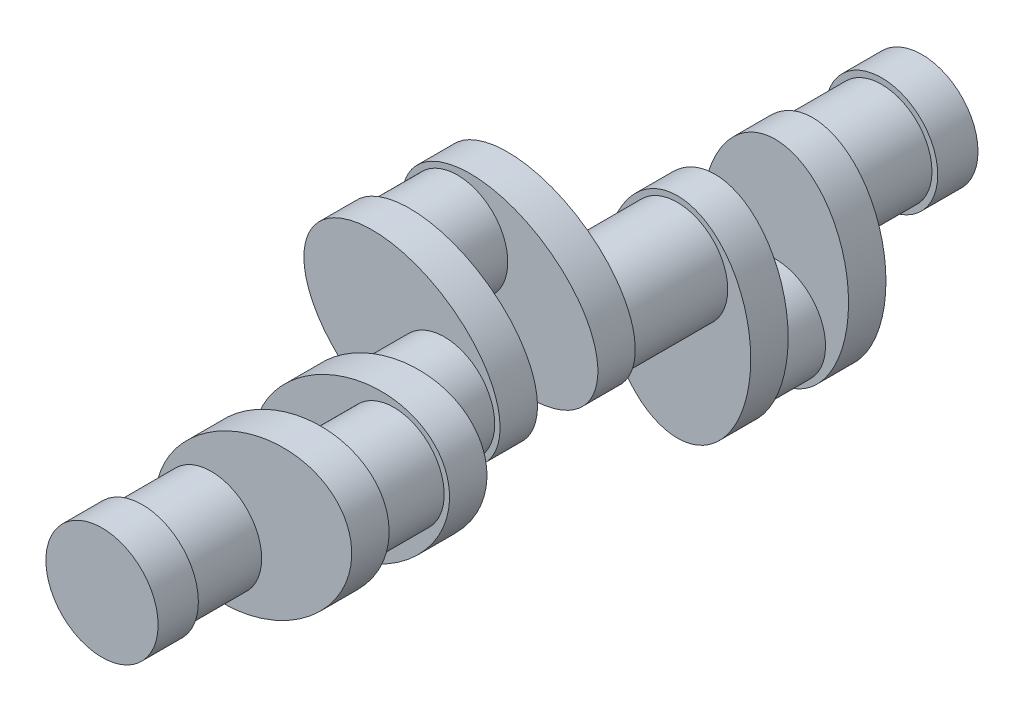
ISO-10303-21;
HEADER;
FILE_DESCRIPTION(('STEP AP214'),'2;1');
FILE_NAME('part.step','',(''),(''),'','','');
FILE_SCHEMA(('AUTOMOTIVE_DESIGN { 1 0 10303 214 1 1 1 1 }'));
ENDSEC;
DATA;
#1=APPLICATION_CONTEXT('core data for automotive mechanical design processes');
#2=APPLICATION_PROTOCOL_DEFINITION('international standard','automotive_design',2000,#1);
#3=PRODUCT_CONTEXT('',#1,'mechanical');
#4=PRODUCT('Part','Part','',(#3));
#5=PRODUCT_RELATED_PRODUCT_CATEGORY('part','',(#4));
#6=PRODUCT_DEFINITION_FORMATION('','',#4);
#7=PRODUCT_DEFINITION_CONTEXT('part definition',#1,'design');
#8=PRODUCT_DEFINITION('design','',#6,#7);
#9=PRODUCT_DEFINITION_SHAPE('','',#8);
#10=(LENGTH_UNIT() NAMED_UNIT(*) SI_UNIT(.MILLI.,.METRE.));
#11=(NAMED_UNIT(*) PLANE_ANGLE_UNIT() SI_UNIT($,.RADIAN.));
#12=(NAMED_UNIT(*) SI_UNIT($,.STERADIAN.) SOLID_ANGLE_UNIT());
#13=UNCERTAINTY_MEASURE_WITH_UNIT(LENGTH_MEASURE(1.E-05),#10,'distance_accuracy_value','');
#14=(GEOMETRIC_REPRESENTATION_CONTEXT(3) GLOBAL_UNCERTAINTY_ASSIGNED_CONTEXT((#13)) GLOBAL_UNIT_ASSIGNED_CONTEXT((#10,
#11,#12)) REPRESENTATION_CONTEXT('',''));
#15=CARTESIAN_POINT('',(0.,0.,0.));
#16=DIRECTION('',(0.,0.,1.));
#17=DIRECTION('',(1.,0.,0.));
#18=AXIS2_PLACEMENT_3D('',#15,#16,#17);
#19=CARTESIAN_POINT('',(0.,-17.,51.));
#20=DIRECTION('',(0.,0.,1.));
#21=DIRECTION('',(0.,1.,0.));
#22=AXIS2_PLACEMENT_3D('',#19,#20,#21);
#23=ELLIPSE('',#22,36.5,25.5);
#24=DIRECTION('',(0.,0.,-1.));
#25=VECTOR('',#24,1.);
#26=SURFACE_OF_LINEAR_EXTRUSION('',#23,#25);
#27=CARTESIAN_POINT('',(0.,19.5,51.));
#28=VERTEX_POINT('',#27);
#29=EDGE_CURVE('E44',#28,#28,#23,.T.);
#30=ORIENTED_EDGE('',*,*,#29,.F.);
#31=EDGE_LOOP('',(#30));
#32=FACE_BOUND('',#31,.T.);
#33=CARTESIAN_POINT('',(0.,-17.,38.));
#34=DIRECTION('',(0.,0.,1.));
#35=DIRECTION('',(0.,1.,0.));
#36=AXIS2_PLACEMENT_3D('',#33,#34,#35);
#37=ELLIPSE('',#36,36.5,25.5);
#38=CARTESIAN_POINT('',(0.,19.5,38.));
#39=VERTEX_POINT('',#38);
#40=EDGE_CURVE('E36',#39,#39,#37,.T.);
#41=ORIENTED_EDGE('',*,*,#40,.T.);
#42=EDGE_LOOP('',(#41));
#43=FACE_BOUND('',#42,.T.);
#44=ADVANCED_FACE('F32',(#32,#43),#26,.F.);
#45=CARTESIAN_POINT('',(0.,-17.,51.));
#46=DIRECTION('',(0.,0.,1.));
#47=DIRECTION('',(1.,0.,0.));
#48=AXIS2_PLACEMENT_3D('',#45,#46,#47);
#49=PLANE('',#48);
#50=CARTESIAN_POINT('',(0.,-34.,51.));
#51=DIRECTION('',(0.,0.,1.));
#52=DIRECTION('',(1.,0.,0.));
#53=AXIS2_PLACEMENT_3D('',#50,#51,#52);
#54=CIRCLE('',#53,17.5);
#55=CARTESIAN_POINT('',(-17.5,-34.,51.));
#56=VERTEX_POINT('',#55);
#57=EDGE_CURVE('E39',#56,#56,#54,.T.);
#58=ORIENTED_EDGE('',*,*,#57,.F.);
#59=EDGE_LOOP('',(#58));
#60=FACE_BOUND('',#59,.T.);
#61=ORIENTED_EDGE('',*,*,#29,.T.);
#62=EDGE_LOOP('',(#61));
#63=FACE_BOUND('',#62,.T.);
#64=ADVANCED_FACE('F71',(#60,#63),#49,.T.);
#65=CARTESIAN_POINT('',(0.,-17.,38.));
#66=DIRECTION('',(0.,0.,1.));
#67=DIRECTION('',(1.,0.,0.));
#68=AXIS2_PLACEMENT_3D('',#65,#66,#67);
#69=PLANE('',#68);
#70=CARTESIAN_POINT('',(0.,0.,38.));
#71=DIRECTION('',(0.,0.,1.));
#72=DIRECTION('',(1.,0.,0.));
#73=AXIS2_PLACEMENT_3D('',#70,#71,#72);
#74=CIRCLE('',#73,17.5);
#75=CARTESIAN_POINT('',(17.5,0.,38.));
#76=VERTEX_POINT('',#75);
#77=EDGE_CURVE('E479',#76,#76,#74,.T.);
#78=ORIENTED_EDGE('',*,*,#77,.T.);
#79=EDGE_LOOP('',(#78));
#80=FACE_BOUND('',#79,.T.);
#81=ORIENTED_EDGE('',*,*,#40,.F.);
#82=EDGE_LOOP('',(#81));
#83=FACE_BOUND('',#82,.T.);
#84=ADVANCED_FACE('F69',(#80,#83),#69,.F.);
#85=CARTESIAN_POINT('',(0.,-34.,72.));
#86=DIRECTION('',(0.,0.,-1.));
#87=DIRECTION('',(-1.,0.,0.));
#88=AXIS2_PLACEMENT_3D('',#85,#86,#87);
#89=CYLINDRICAL_SURFACE('',#88,17.5);
#90=CARTESIAN_POINT('',(0.,-34.,72.));
#91=DIRECTION('',(0.,0.,1.));
#92=DIRECTION('',(1.,0.,0.));
#93=AXIS2_PLACEMENT_3D('',#90,#91,#92);
#94=CIRCLE('',#93,17.5);
#95=CARTESIAN_POINT('',(-17.5,-34.,72.));
#96=VERTEX_POINT('',#95);
#97=EDGE_CURVE('E54',#96,#96,#94,.T.);
#98=CARTESIAN_POINT('',(-17.5,-34.,72.));
#99=CARTESIAN_POINT('',(-17.5,-34.,71.78125));
#100=CARTESIAN_POINT('',(-17.5,-34.,71.5625));
#101=CARTESIAN_POINT('',(-17.5,-34.,71.125));
#102=CARTESIAN_POINT('',(-17.5,-34.,70.90625));
#103=CARTESIAN_POINT('',(-17.5,-34.,70.46875));
#104=CARTESIAN_POINT('',(-17.5,-34.,70.25));
#105=CARTESIAN_POINT('',(-17.5,-34.,69.8125));
#106=CARTESIAN_POINT('',(-17.5,-34.,69.59375));
#107=CARTESIAN_POINT('',(-17.5,-34.,69.15625));
#108=CARTESIAN_POINT('',(-17.5,-34.,68.9375));
#109=CARTESIAN_POINT('',(-17.5,-34.,68.5));
#110=CARTESIAN_POINT('',(-17.5,-34.,68.28125));
#111=CARTESIAN_POINT('',(-17.5,-34.,67.84375));
#112=CARTESIAN_POINT('',(-17.5,-34.,67.625));
#113=CARTESIAN_POINT('',(-17.5,-34.,67.1875));
#114=CARTESIAN_POINT('',(-17.5,-34.,66.96875));
#115=CARTESIAN_POINT('',(-17.5,-34.,66.53125));
#116=CARTESIAN_POINT('',(-17.5,-34.,66.3125));
#117=CARTESIAN_POINT('',(-17.5,-34.,65.875));
#118=CARTESIAN_POINT('',(-17.5,-34.,65.65625));
#119=CARTESIAN_POINT('',(-17.5,-34.,65.21875));
#120=CARTESIAN_POINT('',(-17.5,-34.,65.));
#121=CARTESIAN_POINT('',(-17.5,-34.,64.5625));
#122=CARTESIAN_POINT('',(-17.5,-34.,64.34375));
#123=CARTESIAN_POINT('',(-17.5,-34.,63.90625));
#124=CARTESIAN_POINT('',(-17.5,-34.,63.6875));
#125=CARTESIAN_POINT('',(-17.5,-34.,63.25));
#126=CARTESIAN_POINT('',(-17.5,-34.,63.03125));
#127=CARTESIAN_POINT('',(-17.5,-34.,62.59375));
#128=CARTESIAN_POINT('',(-17.5,-34.,62.375));
#129=CARTESIAN_POINT('',(-17.5,-34.,61.9375));
#130=CARTESIAN_POINT('',(-17.5,-34.,61.71875));
#131=CARTESIAN_POINT('',(-17.5,-34.,61.28125));
#132=CARTESIAN_POINT('',(-17.5,-34.,61.0625));
#133=CARTESIAN_POINT('',(-17.5,-34.,60.625));
#134=CARTESIAN_POINT('',(-17.5,-34.,60.40625));
#135=CARTESIAN_POINT('',(-17.5,-34.,59.96875));
#136=CARTESIAN_POINT('',(-17.5,-34.,59.75));
#137=CARTESIAN_POINT('',(-17.5,-34.,59.3125));
#138=CARTESIAN_POINT('',(-17.5,-34.,59.09375));
#139=CARTESIAN_POINT('',(-17.5,-34.,58.65625));
#140=CARTESIAN_POINT('',(-17.5,-34.,58.4375));
#141=CARTESIAN_POINT('',(-17.5,-34.,58.));
#142=CARTESIAN_POINT('',(-17.5,-34.,57.78125));
#143=CARTESIAN_POINT('',(-17.5,-34.,57.34375));
#144=CARTESIAN_POINT('',(-17.5,-34.,57.125));
#145=CARTESIAN_POINT('',(-17.5,-34.,56.6875));
#146=CARTESIAN_POINT('',(-17.5,-34.,56.46875));
#147=CARTESIAN_POINT('',(-17.5,-34.,56.03125));
#148=CARTESIAN_POINT('',(-17.5,-34.,55.8125));
#149=CARTESIAN_POINT('',(-17.5,-34.,55.375));
#150=CARTESIAN_POINT('',(-17.5,-34.,55.15625));
#151=CARTESIAN_POINT('',(-17.5,-34.,54.71875));
#152=CARTESIAN_POINT('',(-17.5,-34.,54.5));
#153=CARTESIAN_POINT('',(-17.5,-34.,54.0625));
#154=CARTESIAN_POINT('',(-17.5,-34.,53.84375));
#155=CARTESIAN_POINT('',(-17.5,-34.,53.40625));
#156=CARTESIAN_POINT('',(-17.5,-34.,53.1875));
#157=CARTESIAN_POINT('',(-17.5,-34.,52.75));
#158=CARTESIAN_POINT('',(-17.5,-34.,52.53125));
#159=CARTESIAN_POINT('',(-17.5,-34.,52.09375));
#160=CARTESIAN_POINT('',(-17.5,-34.,51.875));
#161=CARTESIAN_POINT('',(-17.5,-34.,51.4375));
#162=CARTESIAN_POINT('',(-17.5,-34.,51.21875));
#163=CARTESIAN_POINT('',(-17.5,-34.,51.));
#164=B_SPLINE_CURVE_WITH_KNOTS('',3,(#98,#99,#100,#101,#102,#103,#104,#105,#106,#107,#108,#109,
#110,#111,#112,#113,#114,#115,#116,#117,#118,#119,#120,#121,#122,#123,#124,#125,#126,#127,#128,
#129,#130,#131,#132,#133,#134,#135,#136,#137,#138,#139,#140,#141,#142,#143,#144,#145,#146,#147,
#148,#149,#150,#151,#152,#153,#154,#155,#156,#157,#158,#159,#160,#161,#162,#163),.UNSPECIFIED.,
.F.,.F.,(4,2,2,2,2,2,2,2,2,2,2,2,2,2,2,2,2,2,2,2,2,2,2,2,2,2,2,2,2,2,2,2,4),(0.,
0.656249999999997,1.31249999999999,1.96874999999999,2.62499999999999,3.28124999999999,3.9375,
4.59374999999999,5.24999999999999,5.90624999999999,6.56249999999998,7.21875,7.87499999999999,
8.53124999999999,9.18749999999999,9.84374999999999,10.5,11.15625,11.8125,12.46875,13.125,
13.78125,14.4375,15.09375,15.75,16.40625,17.0625,17.71875,18.375,19.03125,19.6875,20.34375,21.),.UNSPECIFIED.);
#165=EDGE_CURVE('BSEAM63',#96,#56,#164,.T.);
#166=ORIENTED_EDGE('',*,*,#97,.F.);
#167=ORIENTED_EDGE('',*,*,#57,.T.);
#168=ORIENTED_EDGE('',*,*,#165,.T.);
#169=ORIENTED_EDGE('',*,*,#165,.F.);
#170=EDGE_LOOP('',(#166,#168,#167,#169));
#171=FACE_BOUND('',#170,.T.);
#172=ADVANCED_FACE('F63',(#171),#89,.T.);
#173=CARTESIAN_POINT('',(0.,-17.,85.));
#174=DIRECTION('',(0.,0.,1.));
#175=DIRECTION('',(0.,1.,0.));
#176=AXIS2_PLACEMENT_3D('',#173,#174,#175);
#177=ELLIPSE('',#176,36.5,25.5);
#178=DIRECTION('',(0.,0.,-1.));
#179=VECTOR('',#178,1.);
#180=SURFACE_OF_LINEAR_EXTRUSION('',#177,#179);
#181=CARTESIAN_POINT('',(0.,19.5,85.));
#182=VERTEX_POINT('',#181);
#183=EDGE_CURVE('E50',#182,#182,#177,.T.);
#184=ORIENTED_EDGE('',*,*,#183,.F.);
#185=EDGE_LOOP('',(#184));
#186=FACE_BOUND('',#185,.T.);
#187=CARTESIAN_POINT('',(0.,-17.,72.));
#188=DIRECTION('',(0.,0.,1.));
#189=DIRECTION('',(0.,1.,0.));
#190=AXIS2_PLACEMENT_3D('',#187,#188,#189);
#191=ELLIPSE('',#190,36.5,25.5);
#192=CARTESIAN_POINT('',(0.,19.5,72.));
#193=VERTEX_POINT('',#192);
#194=EDGE_CURVE('E55',#193,#193,#191,.T.);
#195=ORIENTED_EDGE('',*,*,#194,.T.);
#196=EDGE_LOOP('',(#195));
#197=FACE_BOUND('',#196,.T.);
#198=ADVANCED_FACE('F58',(#186,#197),#180,.F.);
#199=CARTESIAN_POINT('',(0.,-17.,85.));
#200=DIRECTION('',(0.,0.,1.));
#201=DIRECTION('',(1.,0.,0.));
#202=AXIS2_PLACEMENT_3D('',#199,#200,#201);
#203=PLANE('',#202);
#204=CARTESIAN_POINT('',(0.,0.,85.));
#205=DIRECTION('',(0.,0.,1.));
#206=DIRECTION('',(1.,0.,0.));
#207=AXIS2_PLACEMENT_3D('',#204,#205,#206);
#208=CIRCLE('',#207,17.5);
#209=CARTESIAN_POINT('',(17.5,0.,85.));
#210=VERTEX_POINT('',#209);
#211=EDGE_CURVE('E10',#210,#210,#208,.T.);
#212=ORIENTED_EDGE('',*,*,#211,.F.);
#213=EDGE_LOOP('',(#212));
#214=FACE_BOUND('',#213,.T.);
#215=ORIENTED_EDGE('',*,*,#183,.T.);
#216=EDGE_LOOP('',(#215));
#217=FACE_BOUND('',#216,.T.);
#218=ADVANCED_FACE('F62',(#214,#217),#203,.T.);
#219=CARTESIAN_POINT('',(0.,-17.,72.));
#220=DIRECTION('',(0.,0.,1.));
#221=DIRECTION('',(1.,0.,0.));
#222=AXIS2_PLACEMENT_3D('',#219,#220,#221);
#223=PLANE('',#222);
#224=ORIENTED_EDGE('',*,*,#97,.T.);
#225=EDGE_LOOP('',(#224));
#226=FACE_BOUND('',#225,.T.);
#227=ORIENTED_EDGE('',*,*,#194,.F.);
#228=EDGE_LOOP('',(#227));
#229=FACE_BOUND('',#228,.T.);
#230=ADVANCED_FACE('F65',(#226,#229),#223,.F.);
#231=CARTESIAN_POINT('',(0.,0.,119.));
#232=DIRECTION('',(0.,0.,-1.));
#233=DIRECTION('',(-1.,0.,0.));
#234=AXIS2_PLACEMENT_3D('',#231,#232,#233);
#235=CYLINDRICAL_SURFACE('',#234,17.5);
#236=CARTESIAN_POINT('',(0.,0.,119.));
#237=DIRECTION('',(0.,0.,1.));
#238=DIRECTION('',(1.,0.,0.));
#239=AXIS2_PLACEMENT_3D('',#236,#237,#238);
#240=CIRCLE('',#239,17.5);
#241=CARTESIAN_POINT('',(17.5,0.,119.));
#242=VERTEX_POINT('',#241);
#243=EDGE_CURVE('E48',#242,#242,#240,.T.);
#244=ORIENTED_EDGE('',*,*,#243,.F.);
#245=EDGE_LOOP('',(#244));
#246=FACE_BOUND('',#245,.T.);
#247=ORIENTED_EDGE('',*,*,#211,.T.);
#248=EDGE_LOOP('',(#247));
#249=FACE_BOUND('',#248,.T.);
#250=ADVANCED_FACE('F101',(#246,#249),#235,.T.);
#251=CARTESIAN_POINT('',(0.,0.,200.));
#252=DIRECTION('',(0.,0.,-1.));
#253=DIRECTION('',(-1.,0.,0.));
#254=AXIS2_PLACEMENT_3D('',#251,#252,#253);
#255=CYLINDRICAL_SURFACE('',#254,17.5);
#256=CARTESIAN_POINT('',(0.,0.,200.));
#257=DIRECTION('',(0.,0.,1.));
#258=DIRECTION('',(1.,0.,0.));
#259=AXIS2_PLACEMENT_3D('',#256,#257,#258);
#260=CIRCLE('',#259,17.5);
#261=CARTESIAN_POINT('',(17.5,0.,200.));
#262=VERTEX_POINT('',#261);
#263=EDGE_CURVE('E106',#262,#262,#260,.T.);
#264=ORIENTED_EDGE('',*,*,#263,.F.);
#265=EDGE_LOOP('',(#264));
#266=FACE_BOUND('',#265,.T.);
#267=CARTESIAN_POINT('',(0.,0.,166.));
#268=DIRECTION('',(0.,0.,1.));
#269=DIRECTION('',(1.,0.,0.));
#270=AXIS2_PLACEMENT_3D('',#267,#268,#269);
#271=CIRCLE('',#270,17.5);
#272=CARTESIAN_POINT('',(17.5,0.,166.));
#273=VERTEX_POINT('',#272);
#274=EDGE_CURVE('E119',#273,#273,#271,.T.);
#275=ORIENTED_EDGE('',*,*,#274,.T.);
#276=EDGE_LOOP('',(#275));
#277=FACE_BOUND('',#276,.T.);
#278=ADVANCED_FACE('F203',(#266,#277),#255,.T.);
#279=CARTESIAN_POINT('',(0.,0.,271.));
#280=DIRECTION('',(0.,0.,-1.));
#281=DIRECTION('',(-1.,0.,0.));
#282=AXIS2_PLACEMENT_3D('',#279,#280,#281);
#283=CYLINDRICAL_SURFACE('',#282,17.5);
#284=CARTESIAN_POINT('',(0.,0.,271.));
#285=DIRECTION('',(0.,0.,1.));
#286=DIRECTION('',(1.,0.,0.));
#287=AXIS2_PLACEMENT_3D('',#284,#285,#286);
#288=CIRCLE('',#287,17.5);
#289=CARTESIAN_POINT('',(17.5,0.,271.));
#290=VERTEX_POINT('',#289);
#291=EDGE_CURVE('E110',#290,#290,#288,.T.);
#292=ORIENTED_EDGE('',*,*,#291,.F.);
#293=EDGE_LOOP('',(#292));
#294=FACE_BOUND('',#293,.T.);
#295=CARTESIAN_POINT('',(0.,0.,247.));
#296=DIRECTION('',(0.,0.,1.));
#297=DIRECTION('',(1.,0.,0.));
#298=AXIS2_PLACEMENT_3D('',#295,#296,#297);
#299=CIRCLE('',#298,17.5);
#300=CARTESIAN_POINT('',(17.5,0.,247.));
#301=VERTEX_POINT('',#300);
#302=EDGE_CURVE('E118',#301,#301,#299,.T.);
#303=ORIENTED_EDGE('',*,*,#302,.T.);
#304=EDGE_LOOP('',(#303));
#305=FACE_BOUND('',#304,.T.);
#306=ADVANCED_FACE('F199',(#294,#305),#283,.T.);
#307=CARTESIAN_POINT('',(0.,0.,285.));
#308=DIRECTION('',(0.,0.,-1.));
#309=DIRECTION('',(-1.,0.,0.));
#310=AXIS2_PLACEMENT_3D('',#307,#308,#309);
#311=CYLINDRICAL_SURFACE('',#310,19.5);
#312=CARTESIAN_POINT('',(0.,0.,285.));
#313=DIRECTION('',(0.,0.,1.));
#314=DIRECTION('',(1.,0.,0.));
#315=AXIS2_PLACEMENT_3D('',#312,#313,#314);
#316=CIRCLE('',#315,19.5);
#317=CARTESIAN_POINT('',(19.5,0.,285.));
#318=VERTEX_POINT('',#317);
#319=EDGE_CURVE('E115',#318,#318,#316,.T.);
#320=ORIENTED_EDGE('',*,*,#319,.F.);
#321=EDGE_LOOP('',(#320));
#322=FACE_BOUND('',#321,.T.);
#323=CARTESIAN_POINT('',(0.,0.,271.));
#324=DIRECTION('',(0.,0.,1.));
#325=DIRECTION('',(1.,0.,0.));
#326=AXIS2_PLACEMENT_3D('',#323,#324,#325);
#327=CIRCLE('',#326,19.5);
#328=CARTESIAN_POINT('',(19.5,0.,271.));
#329=VERTEX_POINT('',#328);
#330=EDGE_CURVE('E512',#329,#329,#327,.T.);
#331=ORIENTED_EDGE('',*,*,#330,.T.);
#332=EDGE_LOOP('',(#331));
#333=FACE_BOUND('',#332,.T.);
#334=ADVANCED_FACE('F192',(#322,#333),#311,.T.);
#335=CARTESIAN_POINT('',(0.,0.,285.));
#336=DIRECTION('',(0.,0.,1.));
#337=DIRECTION('',(1.,0.,0.));
#338=AXIS2_PLACEMENT_3D('',#335,#336,#337);
#339=PLANE('',#338);
#340=ORIENTED_EDGE('',*,*,#319,.T.);
#341=EDGE_LOOP('',(#340));
#342=FACE_BOUND('',#341,.T.);
#343=ADVANCED_FACE('F189',(#342),#339,.T.);
#344=CARTESIAN_POINT('',(0.,0.,271.));
#345=DIRECTION('',(0.,0.,1.));
#346=DIRECTION('',(1.,0.,0.));
#347=AXIS2_PLACEMENT_3D('',#344,#345,#346);
#348=PLANE('',#347);
#349=ORIENTED_EDGE('',*,*,#291,.T.);
#350=EDGE_LOOP('',(#349));
#351=FACE_BOUND('',#350,.T.);
#352=ORIENTED_EDGE('',*,*,#330,.F.);
#353=EDGE_LOOP('',(#352));
#354=FACE_BOUND('',#353,.T.);
#355=ADVANCED_FACE('F186',(#351,#354),#348,.F.);
#356=CARTESIAN_POINT('',(14.7224318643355,8.49999999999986,213.));
#357=DIRECTION('',(0.,0.,1.));
#358=DIRECTION('',(-0.866025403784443,-0.499999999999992,0.));
#359=AXIS2_PLACEMENT_3D('',#356,#357,#358);
#360=ELLIPSE('',#359,36.5,25.5);
#361=DIRECTION('',(0.,0.,-1.));
#362=VECTOR('',#361,1.);
#363=SURFACE_OF_LINEAR_EXTRUSION('',#360,#362);
#364=CARTESIAN_POINT('',(-16.8874953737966,-9.74999999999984,213.));
#365=VERTEX_POINT('',#364);
#366=EDGE_CURVE('E175',#365,#365,#360,.T.);
#367=ORIENTED_EDGE('',*,*,#366,.F.);
#368=EDGE_LOOP('',(#367));
#369=FACE_BOUND('',#368,.T.);
#370=CARTESIAN_POINT('',(14.7224318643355,8.49999999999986,200.));
#371=DIRECTION('',(0.,0.,1.));
#372=DIRECTION('',(-0.866025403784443,-0.499999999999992,0.));
#373=AXIS2_PLACEMENT_3D('',#370,#371,#372);
#374=ELLIPSE('',#373,36.5,25.5);
#375=CARTESIAN_POINT('',(-16.8874953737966,-9.74999999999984,200.));
#376=VERTEX_POINT('',#375);
#377=EDGE_CURVE('E171',#376,#376,#374,.T.);
#378=ORIENTED_EDGE('',*,*,#377,.T.);
#379=EDGE_LOOP('',(#378));
#380=FACE_BOUND('',#379,.T.);
#381=ADVANCED_FACE('F181',(#369,#380),#363,.F.);
#382=CARTESIAN_POINT('',(14.7224318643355,8.49999999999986,213.));
#383=DIRECTION('',(0.,0.,1.));
#384=DIRECTION('',(-0.499999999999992,0.866025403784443,0.));
#385=AXIS2_PLACEMENT_3D('',#382,#383,#384);
#386=PLANE('',#385);
#387=CARTESIAN_POINT('',(29.4448637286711,16.9999999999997,213.));
#388=DIRECTION('',(0.,0.,1.));
#389=DIRECTION('',(-0.499999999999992,0.866025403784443,0.));
#390=AXIS2_PLACEMENT_3D('',#387,#388,#389);
#391=CIRCLE('',#390,17.5);
#392=CARTESIAN_POINT('',(38.1948637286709,1.84455543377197,213.));
#393=VERTEX_POINT('',#392);
#394=EDGE_CURVE('E172',#393,#393,#391,.T.);
#395=ORIENTED_EDGE('',*,*,#394,.F.);
#396=EDGE_LOOP('',(#395));
#397=FACE_BOUND('',#396,.T.);
#398=ORIENTED_EDGE('',*,*,#366,.T.);
#399=EDGE_LOOP('',(#398));
#400=FACE_BOUND('',#399,.T.);
#401=ADVANCED_FACE('F185',(#397,#400),#386,.T.);
#402=CARTESIAN_POINT('',(14.7224318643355,8.49999999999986,200.));
#403=DIRECTION('',(0.,0.,1.));
#404=DIRECTION('',(-0.499999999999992,0.866025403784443,0.));
#405=AXIS2_PLACEMENT_3D('',#402,#403,#404);
#406=PLANE('',#405);
#407=ORIENTED_EDGE('',*,*,#263,.T.);
#408=EDGE_LOOP('',(#407));
#409=FACE_BOUND('',#408,.T.);
#410=ORIENTED_EDGE('',*,*,#377,.F.);
#411=EDGE_LOOP('',(#410));
#412=FACE_BOUND('',#411,.T.);
#413=ADVANCED_FACE('F188',(#409,#412),#406,.F.);
#414=CARTESIAN_POINT('',(29.4448637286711,16.9999999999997,234.));
#415=DIRECTION('',(0.,0.,-1.));
#416=DIRECTION('',(0.499999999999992,-0.866025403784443,0.));
#417=AXIS2_PLACEMENT_3D('',#414,#415,#416);
#418=CYLINDRICAL_SURFACE('',#417,17.5);
#419=CARTESIAN_POINT('',(29.4448637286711,16.9999999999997,234.));
#420=DIRECTION('',(0.,0.,1.));
#421=DIRECTION('',(-0.499999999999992,0.866025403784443,0.));
#422=AXIS2_PLACEMENT_3D('',#419,#420,#421);
#423=CIRCLE('',#422,17.5);
#424=CARTESIAN_POINT('',(38.1948637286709,1.84455543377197,234.));
#425=VERTEX_POINT('',#424);
#426=EDGE_CURVE('E167',#425,#425,#423,.T.);
#427=CARTESIAN_POINT('',(38.1948637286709,1.84455543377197,234.));
#428=CARTESIAN_POINT('',(38.1948637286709,1.84455543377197,233.78125));
#429=CARTESIAN_POINT('',(38.1948637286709,1.84455543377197,233.5625));
#430=CARTESIAN_POINT('',(38.1948637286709,1.84455543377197,233.125));
#431=CARTESIAN_POINT('',(38.1948637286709,1.84455543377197,232.90625));
#432=CARTESIAN_POINT('',(38.1948637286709,1.84455543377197,232.46875));
#433=CARTESIAN_POINT('',(38.1948637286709,1.84455543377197,232.25));
#434=CARTESIAN_POINT('',(38.1948637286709,1.84455543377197,231.8125));
#435=CARTESIAN_POINT('',(38.1948637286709,1.84455543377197,231.59375));
#436=CARTESIAN_POINT('',(38.1948637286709,1.84455543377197,231.15625));
#437=CARTESIAN_POINT('',(38.1948637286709,1.84455543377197,230.9375));
#438=CARTESIAN_POINT('',(38.1948637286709,1.84455543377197,230.5));
#439=CARTESIAN_POINT('',(38.1948637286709,1.84455543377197,230.28125));
#440=CARTESIAN_POINT('',(38.1948637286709,1.84455543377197,229.84375));
#441=CARTESIAN_POINT('',(38.1948637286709,1.84455543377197,229.625));
#442=CARTESIAN_POINT('',(38.1948637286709,1.84455543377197,229.1875));
#443=CARTESIAN_POINT('',(38.1948637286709,1.84455543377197,228.96875));
#444=CARTESIAN_POINT('',(38.1948637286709,1.84455543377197,228.53125));
#445=CARTESIAN_POINT('',(38.1948637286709,1.84455543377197,228.3125));
#446=CARTESIAN_POINT('',(38.1948637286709,1.84455543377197,227.875));
#447=CARTESIAN_POINT('',(38.1948637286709,1.84455543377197,227.65625));
#448=CARTESIAN_POINT('',(38.1948637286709,1.84455543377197,227.21875));
#449=CARTESIAN_POINT('',(38.1948637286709,1.84455543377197,227.));
#450=CARTESIAN_POINT('',(38.1948637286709,1.84455543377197,226.5625));
#451=CARTESIAN_POINT('',(38.1948637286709,1.84455543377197,226.34375));
#452=CARTESIAN_POINT('',(38.1948637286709,1.84455543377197,225.90625));
#453=CARTESIAN_POINT('',(38.1948637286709,1.84455543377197,225.6875));
#454=CARTESIAN_POINT('',(38.1948637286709,1.84455543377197,225.25));
#455=CARTESIAN_POINT('',(38.1948637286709,1.84455543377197,225.03125));
#456=CARTESIAN_POINT('',(38.1948637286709,1.84455543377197,224.59375));
#457=CARTESIAN_POINT('',(38.1948637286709,1.84455543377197,224.375));
#458=CARTESIAN_POINT('',(38.1948637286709,1.84455543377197,223.9375));
#459=CARTESIAN_POINT('',(38.1948637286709,1.84455543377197,223.71875));
#460=CARTESIAN_POINT('',(38.1948637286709,1.84455543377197,223.28125));
#461=CARTESIAN_POINT('',(38.1948637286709,1.84455543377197,223.0625));
#462=CARTESIAN_POINT('',(38.1948637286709,1.84455543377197,222.625));
#463=CARTESIAN_POINT('',(38.1948637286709,1.84455543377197,222.40625));
#464=CARTESIAN_POINT('',(38.1948637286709,1.84455543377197,221.96875));
#465=CARTESIAN_POINT('',(38.1948637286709,1.84455543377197,221.75));
#466=CARTESIAN_POINT('',(38.1948637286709,1.84455543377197,221.3125));
#467=CARTESIAN_POINT('',(38.1948637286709,1.84455543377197,221.09375));
#468=CARTESIAN_POINT('',(38.1948637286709,1.84455543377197,220.65625));
#469=CARTESIAN_POINT('',(38.1948637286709,1.84455543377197,220.4375));
#470=CARTESIAN_POINT('',(38.1948637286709,1.84455543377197,220.));
#471=CARTESIAN_POINT('',(38.1948637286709,1.84455543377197,219.78125));
#472=CARTESIAN_POINT('',(38.1948637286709,1.84455543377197,219.34375));
#473=CARTESIAN_POINT('',(38.1948637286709,1.84455543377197,219.125));
#474=CARTESIAN_POINT('',(38.1948637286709,1.84455543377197,218.6875));
#475=CARTESIAN_POINT('',(38.1948637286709,1.84455543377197,218.46875));
#476=CARTESIAN_POINT('',(38.1948637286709,1.84455543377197,218.03125));
#477=CARTESIAN_POINT('',(38.1948637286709,1.84455543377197,217.8125));
#478=CARTESIAN_POINT('',(38.1948637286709,1.84455543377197,217.375));
#479=CARTESIAN_POINT('',(38.1948637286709,1.84455543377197,217.15625));
#480=CARTESIAN_POINT('',(38.1948637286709,1.84455543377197,216.71875));
#481=CARTESIAN_POINT('',(38.1948637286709,1.84455543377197,216.5));
#482=CARTESIAN_POINT('',(38.1948637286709,1.84455543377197,216.0625));
#483=CARTESIAN_POINT('',(38.1948637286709,1.84455543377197,215.84375));
#484=CARTESIAN_POINT('',(38.1948637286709,1.84455543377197,215.40625));
#485=CARTESIAN_POINT('',(38.1948637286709,1.84455543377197,215.1875));
#486=CARTESIAN_POINT('',(38.1948637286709,1.84455543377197,214.75));
#487=CARTESIAN_POINT('',(38.1948637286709,1.84455543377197,214.53125));
#488=CARTESIAN_POINT('',(38.1948637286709,1.84455543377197,214.09375));
#489=CARTESIAN_POINT('',(38.1948637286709,1.84455543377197,213.875));
#490=CARTESIAN_POINT('',(38.1948637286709,1.84455543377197,213.4375));
#491=CARTESIAN_POINT('',(38.1948637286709,1.84455543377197,213.21875));
#492=CARTESIAN_POINT('',(38.1948637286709,1.84455543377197,213.));
#493=B_SPLINE_CURVE_WITH_KNOTS('',3,(#427,#428,#429,#430,#431,#432,#433,#434,#435,#436,#437,
#438,#439,#440,#441,#442,#443,#444,#445,#446,#447,#448,#449,#450,#451,#452,#453,#454,#455,#456,
#457,#458,#459,#460,#461,#462,#463,#464,#465,#466,#467,#468,#469,#470,#471,#472,#473,#474,#475,
#476,#477,#478,#479,#480,#481,#482,#483,#484,#485,#486,#487,#488,#489,#490,#491,#492),
.UNSPECIFIED.,.F.,.F.,(4,2,2,2,2,2,2,2,2,2,2,2,2,2,2,2,2,2,2,2,2,2,2,2,2,2,2,2,2,2,2,2,4),(0.,
0.656250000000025,1.31250000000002,1.96875000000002,2.62500000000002,3.28125000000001,
3.93750000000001,4.59375000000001,5.25,5.90625,6.5625,7.21875,7.87500000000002,8.53125000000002,
9.18750000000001,9.84375000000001,10.5,11.15625,11.8125,12.46875,13.125,13.78125,14.4375,
15.09375,15.75,16.40625,17.0625,17.71875,18.375,19.03125,19.6875,20.34375,21.),.UNSPECIFIED.);
#494=EDGE_CURVE('BSEAM162',#425,#393,#493,.T.);
#495=ORIENTED_EDGE('',*,*,#426,.F.);
#496=ORIENTED_EDGE('',*,*,#394,.T.);
#497=ORIENTED_EDGE('',*,*,#494,.T.);
#498=ORIENTED_EDGE('',*,*,#494,.F.);
#499=EDGE_LOOP('',(#495,#497,#496,#498));
#500=FACE_BOUND('',#499,.T.);
#501=ADVANCED_FACE('F162',(#500),#418,.T.);
#502=CARTESIAN_POINT('',(14.7224318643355,8.49999999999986,247.));
#503=DIRECTION('',(0.,0.,1.));
#504=DIRECTION('',(-0.866025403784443,-0.499999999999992,0.));
#505=AXIS2_PLACEMENT_3D('',#502,#503,#504);
#506=ELLIPSE('',#505,36.5,25.5);
#507=DIRECTION('',(0.,0.,-1.));
#508=VECTOR('',#507,1.);
#509=SURFACE_OF_LINEAR_EXTRUSION('',#506,#508);
#510=CARTESIAN_POINT('',(-16.8874953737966,-9.74999999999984,247.));
#511=VERTEX_POINT('',#510);
#512=EDGE_CURVE('E126',#511,#511,#506,.T.);
#513=ORIENTED_EDGE('',*,*,#512,.F.);
#514=EDGE_LOOP('',(#513));
#515=FACE_BOUND('',#514,.T.);
#516=CARTESIAN_POINT('',(14.7224318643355,8.49999999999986,234.));
#517=DIRECTION('',(0.,0.,1.));
#518=DIRECTION('',(-0.866025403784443,-0.499999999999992,0.));
#519=AXIS2_PLACEMENT_3D('',#516,#517,#518);
#520=ELLIPSE('',#519,36.5,25.5);
#521=CARTESIAN_POINT('',(-16.8874953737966,-9.74999999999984,234.));
#522=VERTEX_POINT('',#521);
#523=EDGE_CURVE('E121',#522,#522,#520,.T.);
#524=ORIENTED_EDGE('',*,*,#523,.T.);
#525=EDGE_LOOP('',(#524));
#526=FACE_BOUND('',#525,.T.);
#527=ADVANCED_FACE('F155',(#515,#526),#509,.F.);
#528=CARTESIAN_POINT('',(14.7224318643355,8.49999999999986,247.));
#529=DIRECTION('',(0.,0.,1.));
#530=DIRECTION('',(-0.499999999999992,0.866025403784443,0.));
#531=AXIS2_PLACEMENT_3D('',#528,#529,#530);
#532=PLANE('',#531);
#533=ORIENTED_EDGE('',*,*,#302,.F.);
#534=EDGE_LOOP('',(#533));
#535=FACE_BOUND('',#534,.T.);
#536=ORIENTED_EDGE('',*,*,#512,.T.);
#537=EDGE_LOOP('',(#536));
#538=FACE_BOUND('',#537,.T.);
#539=ADVANCED_FACE('F152',(#535,#538),#532,.T.);
#540=CARTESIAN_POINT('',(14.7224318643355,8.49999999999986,234.));
#541=DIRECTION('',(0.,0.,1.));
#542=DIRECTION('',(-0.499999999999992,0.866025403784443,0.));
#543=AXIS2_PLACEMENT_3D('',#540,#541,#542);
#544=PLANE('',#543);
#545=ORIENTED_EDGE('',*,*,#426,.T.);
#546=EDGE_LOOP('',(#545));
#547=FACE_BOUND('',#546,.T.);
#548=ORIENTED_EDGE('',*,*,#523,.F.);
#549=EDGE_LOOP('',(#548));
#550=FACE_BOUND('',#549,.T.);
#551=ADVANCED_FACE('F148',(#547,#550),#544,.F.);
#552=CARTESIAN_POINT('',(-14.7224318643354,8.50000000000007,132.));
#553=DIRECTION('',(0.,0.,1.));
#554=DIRECTION('',(0.866025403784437,-0.500000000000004,0.));
#555=AXIS2_PLACEMENT_3D('',#552,#553,#554);
#556=ELLIPSE('',#555,36.5,25.5);
#557=DIRECTION('',(0.,0.,-1.));
#558=VECTOR('',#557,1.);
#559=SURFACE_OF_LINEAR_EXTRUSION('',#556,#558);
#560=CARTESIAN_POINT('',(16.8874953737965,-9.75000000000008,132.));
#561=VERTEX_POINT('',#560);
#562=EDGE_CURVE('E129',#561,#561,#556,.T.);
#563=ORIENTED_EDGE('',*,*,#562,.F.);
#564=EDGE_LOOP('',(#563));
#565=FACE_BOUND('',#564,.T.);
#566=CARTESIAN_POINT('',(-14.7224318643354,8.50000000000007,119.));
#567=DIRECTION('',(0.,0.,1.));
#568=DIRECTION('',(0.866025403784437,-0.500000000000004,0.));
#569=AXIS2_PLACEMENT_3D('',#566,#567,#568);
#570=ELLIPSE('',#569,36.5,25.5);
#571=CARTESIAN_POINT('',(16.8874953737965,-9.75000000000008,119.));
#572=VERTEX_POINT('',#571);
#573=EDGE_CURVE('E134',#572,#572,#570,.T.);
#574=ORIENTED_EDGE('',*,*,#573,.T.);
#575=EDGE_LOOP('',(#574));
#576=FACE_BOUND('',#575,.T.);
#577=ADVANCED_FACE('F143',(#565,#576),#559,.F.);
#578=CARTESIAN_POINT('',(-14.7224318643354,8.50000000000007,132.));
#579=DIRECTION('',(0.,0.,1.));
#580=DIRECTION('',(-0.500000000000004,-0.866025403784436,0.));
#581=AXIS2_PLACEMENT_3D('',#578,#579,#580);
#582=PLANE('',#581);
#583=CARTESIAN_POINT('',(-29.4448637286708,17.0000000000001,132.));
#584=DIRECTION('',(0.,0.,1.));
#585=DIRECTION('',(-0.500000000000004,-0.866025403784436,0.));
#586=AXIS2_PLACEMENT_3D('',#583,#584,#585);
#587=CIRCLE('',#586,17.5);
#588=CARTESIAN_POINT('',(-20.6948637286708,32.1554445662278,132.));
#589=VERTEX_POINT('',#588);
#590=EDGE_CURVE('E122',#589,#589,#587,.T.);
#591=ORIENTED_EDGE('',*,*,#590,.F.);
#592=EDGE_LOOP('',(#591));
#593=FACE_BOUND('',#592,.T.);
#594=ORIENTED_EDGE('',*,*,#562,.T.);
#595=EDGE_LOOP('',(#594));
#596=FACE_BOUND('',#595,.T.);
#597=ADVANCED_FACE('F147',(#593,#596),#582,.T.);
#598=CARTESIAN_POINT('',(-14.7224318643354,8.50000000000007,119.));
#599=DIRECTION('',(0.,0.,1.));
#600=DIRECTION('',(-0.500000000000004,-0.866025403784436,0.));
#601=AXIS2_PLACEMENT_3D('',#598,#599,#600);
#602=PLANE('',#601);
#603=ORIENTED_EDGE('',*,*,#243,.T.);
#604=EDGE_LOOP('',(#603));
#605=FACE_BOUND('',#604,.T.);
#606=ORIENTED_EDGE('',*,*,#573,.F.);
#607=EDGE_LOOP('',(#606));
#608=FACE_BOUND('',#607,.T.);
#609=ADVANCED_FACE('F150',(#605,#608),#602,.F.);
#610=CARTESIAN_POINT('',(-29.4448637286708,17.0000000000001,153.));
#611=DIRECTION('',(0.,0.,-1.));
#612=DIRECTION('',(0.500000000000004,0.866025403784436,0.));
#613=AXIS2_PLACEMENT_3D('',#610,#611,#612);
#614=CYLINDRICAL_SURFACE('',#613,17.5);
#615=CARTESIAN_POINT('',(-29.4448637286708,17.0000000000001,153.));
#616=DIRECTION('',(0.,0.,1.));
#617=DIRECTION('',(-0.500000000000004,-0.866025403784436,0.));
#618=AXIS2_PLACEMENT_3D('',#615,#616,#617);
#619=CIRCLE('',#618,17.5);
#620=CARTESIAN_POINT('',(-20.6948637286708,32.1554445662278,153.));
#621=VERTEX_POINT('',#620);
#622=EDGE_CURVE('E137',#621,#621,#619,.T.);
#623=CARTESIAN_POINT('',(-20.6948637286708,32.1554445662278,153.));
#624=CARTESIAN_POINT('',(-20.6948637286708,32.1554445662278,152.78125));
#625=CARTESIAN_POINT('',(-20.6948637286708,32.1554445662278,152.5625));
#626=CARTESIAN_POINT('',(-20.6948637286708,32.1554445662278,152.125));
#627=CARTESIAN_POINT('',(-20.6948637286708,32.1554445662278,151.90625));
#628=CARTESIAN_POINT('',(-20.6948637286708,32.1554445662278,151.46875));
#629=CARTESIAN_POINT('',(-20.6948637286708,32.1554445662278,151.25));
#630=CARTESIAN_POINT('',(-20.6948637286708,32.1554445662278,150.8125));
#631=CARTESIAN_POINT('',(-20.6948637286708,32.1554445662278,150.59375));
#632=CARTESIAN_POINT('',(-20.6948637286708,32.1554445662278,150.15625));
#633=CARTESIAN_POINT('',(-20.6948637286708,32.1554445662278,149.9375));
#634=CARTESIAN_POINT('',(-20.6948637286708,32.1554445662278,149.5));
#635=CARTESIAN_POINT('',(-20.6948637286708,32.1554445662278,149.28125));
#636=CARTESIAN_POINT('',(-20.6948637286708,32.1554445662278,148.84375));
#637=CARTESIAN_POINT('',(-20.6948637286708,32.1554445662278,148.625));
#638=CARTESIAN_POINT('',(-20.6948637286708,32.1554445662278,148.1875));
#639=CARTESIAN_POINT('',(-20.6948637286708,32.1554445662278,147.96875));
#640=CARTESIAN_POINT('',(-20.6948637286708,32.1554445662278,147.53125));
#641=CARTESIAN_POINT('',(-20.6948637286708,32.1554445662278,147.3125));
#642=CARTESIAN_POINT('',(-20.6948637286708,32.1554445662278,146.875));
#643=CARTESIAN_POINT('',(-20.6948637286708,32.1554445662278,146.65625));
#644=CARTESIAN_POINT('',(-20.6948637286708,32.1554445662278,146.21875));
#645=CARTESIAN_POINT('',(-20.6948637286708,32.1554445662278,146.));
#646=CARTESIAN_POINT('',(-20.6948637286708,32.1554445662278,145.5625));
#647=CARTESIAN_POINT('',(-20.6948637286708,32.1554445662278,145.34375));
#648=CARTESIAN_POINT('',(-20.6948637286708,32.1554445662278,144.90625));
#649=CARTESIAN_POINT('',(-20.6948637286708,32.1554445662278,144.6875));
#650=CARTESIAN_POINT('',(-20.6948637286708,32.1554445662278,144.25));
#651=CARTESIAN_POINT('',(-20.6948637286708,32.1554445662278,144.03125));
#652=CARTESIAN_POINT('',(-20.6948637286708,32.1554445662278,143.59375));
#653=CARTESIAN_POINT('',(-20.6948637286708,32.1554445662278,143.375));
#654=CARTESIAN_POINT('',(-20.6948637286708,32.1554445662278,142.9375));
#655=CARTESIAN_POINT('',(-20.6948637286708,32.1554445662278,142.71875));
#656=CARTESIAN_POINT('',(-20.6948637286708,32.1554445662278,142.28125));
#657=CARTESIAN_POINT('',(-20.6948637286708,32.1554445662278,142.0625));
#658=CARTESIAN_POINT('',(-20.6948637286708,32.1554445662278,141.625));
#659=CARTESIAN_POINT('',(-20.6948637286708,32.1554445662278,141.40625));
#660=CARTESIAN_POINT('',(-20.6948637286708,32.1554445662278,140.96875));
#661=CARTESIAN_POINT('',(-20.6948637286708,32.1554445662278,140.75));
#662=CARTESIAN_POINT('',(-20.6948637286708,32.1554445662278,140.3125));
#663=CARTESIAN_POINT('',(-20.6948637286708,32.1554445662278,140.09375));
#664=CARTESIAN_POINT('',(-20.6948637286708,32.1554445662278,139.65625));
#665=CARTESIAN_POINT('',(-20.6948637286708,32.1554445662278,139.4375));
#666=CARTESIAN_POINT('',(-20.6948637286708,32.1554445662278,139.));
#667=CARTESIAN_POINT('',(-20.6948637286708,32.1554445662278,138.78125));
#668=CARTESIAN_POINT('',(-20.6948637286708,32.1554445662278,138.34375));
#669=CARTESIAN_POINT('',(-20.6948637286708,32.1554445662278,138.125));
#670=CARTESIAN_POINT('',(-20.6948637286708,32.1554445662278,137.6875));
#671=CARTESIAN_POINT('',(-20.6948637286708,32.1554445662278,137.46875));
#672=CARTESIAN_POINT('',(-20.6948637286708,32.1554445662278,137.03125));
#673=CARTESIAN_POINT('',(-20.6948637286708,32.1554445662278,136.8125));
#674=CARTESIAN_POINT('',(-20.6948637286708,32.1554445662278,136.375));
#675=CARTESIAN_POINT('',(-20.6948637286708,32.1554445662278,136.15625));
#676=CARTESIAN_POINT('',(-20.6948637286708,32.1554445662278,135.71875));
#677=CARTESIAN_POINT('',(-20.6948637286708,32.1554445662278,135.5));
#678=CARTESIAN_POINT('',(-20.6948637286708,32.1554445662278,135.0625));
#679=CARTESIAN_POINT('',(-20.6948637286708,32.1554445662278,134.84375));
#680=CARTESIAN_POINT('',(-20.6948637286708,32.1554445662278,134.40625));
#681=CARTESIAN_POINT('',(-20.6948637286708,32.1554445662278,134.1875));
#682=CARTESIAN_POINT('',(-20.6948637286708,32.1554445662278,133.75));
#683=CARTESIAN_POINT('',(-20.6948637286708,32.1554445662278,133.53125));
#684=CARTESIAN_POINT('',(-20.6948637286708,32.1554445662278,133.09375));
#685=CARTESIAN_POINT('',(-20.6948637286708,32.1554445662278,132.875));
#686=CARTESIAN_POINT('',(-20.6948637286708,32.1554445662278,132.4375));
#687=CARTESIAN_POINT('',(-20.6948637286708,32.1554445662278,132.21875));
#688=CARTESIAN_POINT('',(-20.6948637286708,32.1554445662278,132.));
#689=B_SPLINE_CURVE_WITH_KNOTS('',3,(#623,#624,#625,#626,#627,#628,#629,#630,#631,#632,#633,
#634,#635,#636,#637,#638,#639,#640,#641,#642,#643,#644,#645,#646,#647,#648,#649,#650,#651,#652,
#653,#654,#655,#656,#657,#658,#659,#660,#661,#662,#663,#664,#665,#666,#667,#668,#669,#670,#671,
#672,#673,#674,#675,#676,#677,#678,#679,#680,#681,#682,#683,#684,#685,#686,#687,#688),
.UNSPECIFIED.,.F.,.F.,(4,2,2,2,2,2,2,2,2,2,2,2,2,2,2,2,2,2,2,2,2,2,2,2,2,2,2,2,2,2,2,2,4),(0.,
0.656250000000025,1.31250000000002,1.96875000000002,2.62500000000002,3.28125000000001,
3.93750000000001,4.59375000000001,5.25,5.90625,6.5625,7.21875000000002,7.87500000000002,
8.53125000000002,9.18750000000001,9.84375000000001,10.5,11.15625,11.8125,12.46875,13.125,
13.78125,14.4375,15.09375,15.75,16.40625,17.0625,17.71875,18.375,19.03125,19.6875,20.34375,21.),.UNSPECIFIED.);
#690=EDGE_CURVE('BSEAM270',#621,#589,#689,.T.);
#691=ORIENTED_EDGE('',*,*,#622,.F.);
#692=ORIENTED_EDGE('',*,*,#590,.T.);
#693=ORIENTED_EDGE('',*,*,#690,.T.);
#694=ORIENTED_EDGE('',*,*,#690,.F.);
#695=EDGE_LOOP('',(#691,#693,#692,#694));
#696=FACE_BOUND('',#695,.T.);
#697=ADVANCED_FACE('F270',(#696),#614,.T.);
#698=CARTESIAN_POINT('',(-14.7224318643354,8.50000000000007,166.));
#699=DIRECTION('',(0.,0.,1.));
#700=DIRECTION('',(0.866025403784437,-0.500000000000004,0.));
#701=AXIS2_PLACEMENT_3D('',#698,#699,#700);
#702=ELLIPSE('',#701,36.5,25.5);
#703=DIRECTION('',(0.,0.,-1.));
#704=VECTOR('',#703,1.);
#705=SURFACE_OF_LINEAR_EXTRUSION('',#702,#704);
#706=CARTESIAN_POINT('',(16.8874953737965,-9.75000000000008,166.));
#707=VERTEX_POINT('',#706);
#708=EDGE_CURVE('E462',#707,#707,#702,.T.);
#709=ORIENTED_EDGE('',*,*,#708,.F.);
#710=EDGE_LOOP('',(#709));
#711=FACE_BOUND('',#710,.T.);
#712=CARTESIAN_POINT('',(-14.7224318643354,8.50000000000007,153.));
#713=DIRECTION('',(0.,0.,1.));
#714=DIRECTION('',(0.866025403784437,-0.500000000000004,0.));
#715=AXIS2_PLACEMENT_3D('',#712,#713,#714);
#716=ELLIPSE('',#715,36.5,25.5);
#717=CARTESIAN_POINT('',(16.8874953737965,-9.75000000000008,153.));
#718=VERTEX_POINT('',#717);
#719=EDGE_CURVE('E466',#718,#718,#716,.T.);
#720=ORIENTED_EDGE('',*,*,#719,.T.);
#721=EDGE_LOOP('',(#720));
#722=FACE_BOUND('',#721,.T.);
#723=ADVANCED_FACE('F275',(#711,#722),#705,.F.);
#724=CARTESIAN_POINT('',(-14.7224318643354,8.50000000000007,166.));
#725=DIRECTION('',(0.,0.,1.));
#726=DIRECTION('',(-0.500000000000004,-0.866025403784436,0.));
#727=AXIS2_PLACEMENT_3D('',#724,#725,#726);
#728=PLANE('',#727);
#729=ORIENTED_EDGE('',*,*,#274,.F.);
#730=EDGE_LOOP('',(#729));
#731=FACE_BOUND('',#730,.T.);
#732=ORIENTED_EDGE('',*,*,#708,.T.);
#733=EDGE_LOOP('',(#732));
#734=FACE_BOUND('',#733,.T.);
#735=ADVANCED_FACE('F282',(#731,#734),#728,.T.);
#736=CARTESIAN_POINT('',(-14.7224318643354,8.50000000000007,153.));
#737=DIRECTION('',(0.,0.,1.));
#738=DIRECTION('',(-0.500000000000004,-0.866025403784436,0.));
#739=AXIS2_PLACEMENT_3D('',#736,#737,#738);
#740=PLANE('',#739);
#741=ORIENTED_EDGE('',*,*,#622,.T.);
#742=EDGE_LOOP('',(#741));
#743=FACE_BOUND('',#742,.T.);
#744=ORIENTED_EDGE('',*,*,#719,.F.);
#745=EDGE_LOOP('',(#744));
#746=FACE_BOUND('',#745,.T.);
#747=ADVANCED_FACE('F289',(#743,#746),#740,.F.);
#748=CARTESIAN_POINT('',(0.,0.,14.));
#749=DIRECTION('',(0.,0.,-1.));
#750=DIRECTION('',(-1.,0.,0.));
#751=AXIS2_PLACEMENT_3D('',#748,#749,#750);
#752=CYLINDRICAL_SURFACE('',#751,19.5);
#753=CARTESIAN_POINT('',(0.,0.,14.));
#754=DIRECTION('',(0.,0.,1.));
#755=DIRECTION('',(1.,0.,0.));
#756=AXIS2_PLACEMENT_3D('',#753,#754,#755);
#757=CIRCLE('',#756,19.5);
#758=CARTESIAN_POINT('',(19.5,0.,14.));
#759=VERTEX_POINT('',#758);
#760=EDGE_CURVE('E474',#759,#759,#757,.T.);
#761=ORIENTED_EDGE('',*,*,#760,.F.);
#762=EDGE_LOOP('',(#761));
#763=FACE_BOUND('',#762,.T.);
#764=CARTESIAN_POINT('',(0.,0.,0.));
#765=DIRECTION('',(0.,0.,1.));
#766=DIRECTION('',(1.,0.,0.));
#767=AXIS2_PLACEMENT_3D('',#764,#765,#766);
#768=CIRCLE('',#767,19.5);
#769=CARTESIAN_POINT('',(19.5,0.,0.));
#770=VERTEX_POINT('',#769);
#771=EDGE_CURVE('E467',#770,#770,#768,.T.);
#772=ORIENTED_EDGE('',*,*,#771,.T.);
#773=EDGE_LOOP('',(#772));
#774=FACE_BOUND('',#773,.T.);
#775=ADVANCED_FACE('F296',(#763,#774),#752,.T.);
#776=CARTESIAN_POINT('',(0.,0.,14.));
#777=DIRECTION('',(0.,0.,1.));
#778=DIRECTION('',(1.,0.,0.));
#779=AXIS2_PLACEMENT_3D('',#776,#777,#778);
#780=PLANE('',#779);
#781=CARTESIAN_POINT('',(0.,0.,14.));
#782=DIRECTION('',(0.,0.,1.));
#783=DIRECTION('',(1.,0.,0.));
#784=AXIS2_PLACEMENT_3D('',#781,#782,#783);
#785=CIRCLE('',#784,17.5);
#786=CARTESIAN_POINT('',(17.5,0.,14.));
#787=VERTEX_POINT('',#786);
#788=EDGE_CURVE('E470',#787,#787,#785,.T.);
#789=ORIENTED_EDGE('',*,*,#788,.F.);
#790=EDGE_LOOP('',(#789));
#791=FACE_BOUND('',#790,.T.);
#792=ORIENTED_EDGE('',*,*,#760,.T.);
#793=EDGE_LOOP('',(#792));
#794=FACE_BOUND('',#793,.T.);
#795=ADVANCED_FACE('F303',(#791,#794),#780,.T.);
#796=CARTESIAN_POINT('',(0.,0.,0.));
#797=DIRECTION('',(0.,0.,1.));
#798=DIRECTION('',(1.,0.,0.));
#799=AXIS2_PLACEMENT_3D('',#796,#797,#798);
#800=PLANE('',#799);
#801=ORIENTED_EDGE('',*,*,#771,.F.);
#802=EDGE_LOOP('',(#801));
#803=FACE_BOUND('',#802,.T.);
#804=ADVANCED_FACE('F310',(#803),#800,.F.);
#805=CARTESIAN_POINT('',(0.,0.,38.));
#806=DIRECTION('',(0.,0.,-1.));
#807=DIRECTION('',(-1.,0.,0.));
#808=AXIS2_PLACEMENT_3D('',#805,#806,#807);
#809=CYLINDRICAL_SURFACE('',#808,17.5);
#810=ORIENTED_EDGE('',*,*,#77,.F.);
#811=EDGE_LOOP('',(#810));
#812=FACE_BOUND('',#811,.T.);
#813=ORIENTED_EDGE('',*,*,#788,.T.);
#814=EDGE_LOOP('',(#813));
#815=FACE_BOUND('',#814,.T.);
#816=ADVANCED_FACE('F317',(#812,#815),#809,.T.);
#817=CLOSED_SHELL('',(#44,#64,#84,#172,#198,#218,#230,#250,#278,#306,#334,#343,#355,#381,#401,
#413,#501,#527,#539,#551,#577,#597,#609,#697,#723,#735,#747,#775,#795,#804,#816));
#818=MANIFOLD_SOLID_BREP('B2',#817);
#819=ADVANCED_BREP_SHAPE_REPRESENTATION('',(#18,#818),#14);
#820=SHAPE_DEFINITION_REPRESENTATION(#9,#819);
ENDSEC;
END-ISO-10303-21;
